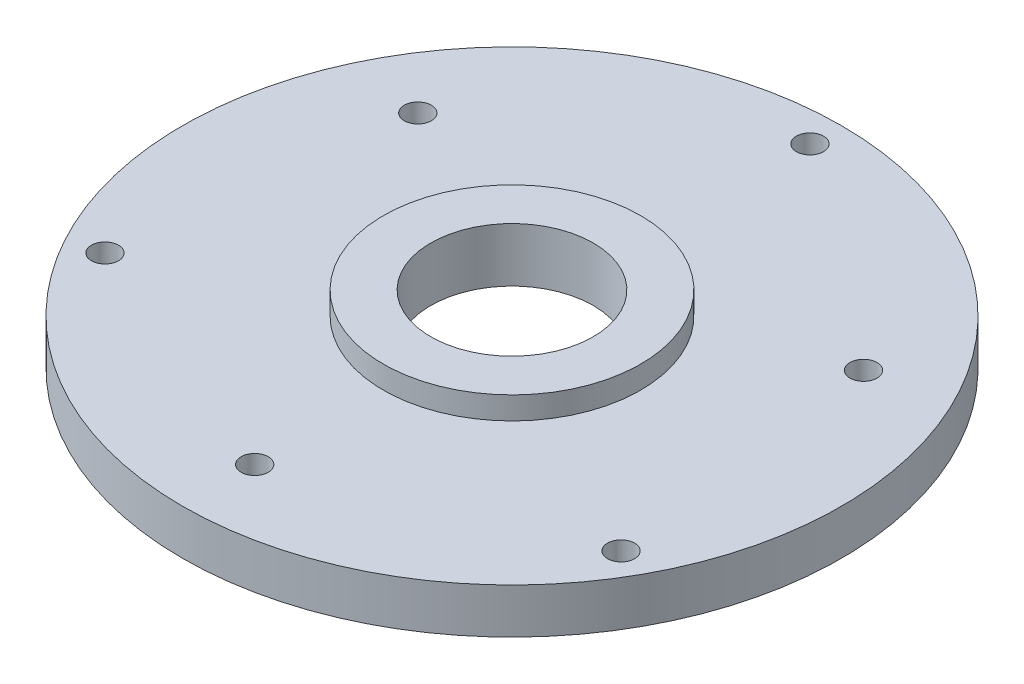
from build123d import *

# Parameters (mm, degrees)
SCHIZZO2_R               = 1.5
TAGLIO_ESTRUSIONE1_DEPTH = 52.860389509
SCHIZZO6_R               = 1.5
TAGLIO_ESTRUSIONE3_DEPTH = 53.160809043


with BuildPart() as part:
    # Schizzo1 → Rivoluzione1 (revolve)
    with BuildSketch(Plane.XY, mode=Mode.PRIVATE) as rivoluzione1_sk:
        Polygon((36.5, 39.385931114), (36.5, 34.385931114), (15, 34.385931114), (15, 35.885931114), (9, 35.885931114), (9, 41.885931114), (14.25, 41.885931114), (14.25, 39.385931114), align=None)
    revolve(rivoluzione1_sk.sketch.rotate(Axis((0, 0, 0), (0, 1, 0)), 90), axis=Axis((0, 0, 0), (0, 1, 0)))

    # Schizzo2 → Taglio-Estrusione1 (cut, through all)
    with BuildSketch(Plane(origin=(0, 39.385931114, 0), x_dir=(1, 0, 0), z_dir=(0, 1, 0))):
        with Locations(Location((0, 33, 0), (0, 0, 270))):
            Circle(SCHIZZO2_R)
        with Locations(Location((28.578838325, -16.5, 0), (0, 0, 270))):
            Circle(SCHIZZO2_R)
        with Locations(Location((-28.578838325, -16.5, 0), (0, 0, 270))):
            Circle(SCHIZZO2_R)
    extrude(amount=-TAGLIO_ESTRUSIONE1_DEPTH, mode=Mode.SUBTRACT)

    # Schizzo6 → Taglio-Estrusione3 (cut, through all)
    with BuildSketch(Plane(origin=(0, 34.385931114, 0), x_dir=(-1, 0, 0), z_dir=(0, -1, 0))):
        with Locations(Location((0, -28.5, 0), (0, 0, 90))):
            Circle(SCHIZZO6_R)
        with Locations(Location((-24.681724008, 14.25, 0), (0, 0, 90))):
            Circle(SCHIZZO6_R)
        with Locations(Location((24.681724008, 14.25, 0), (0, 0, 90))):
            Circle(SCHIZZO6_R)
    extrude(amount=-TAGLIO_ESTRUSIONE3_DEPTH, mode=Mode.SUBTRACT)


solid = part.part
